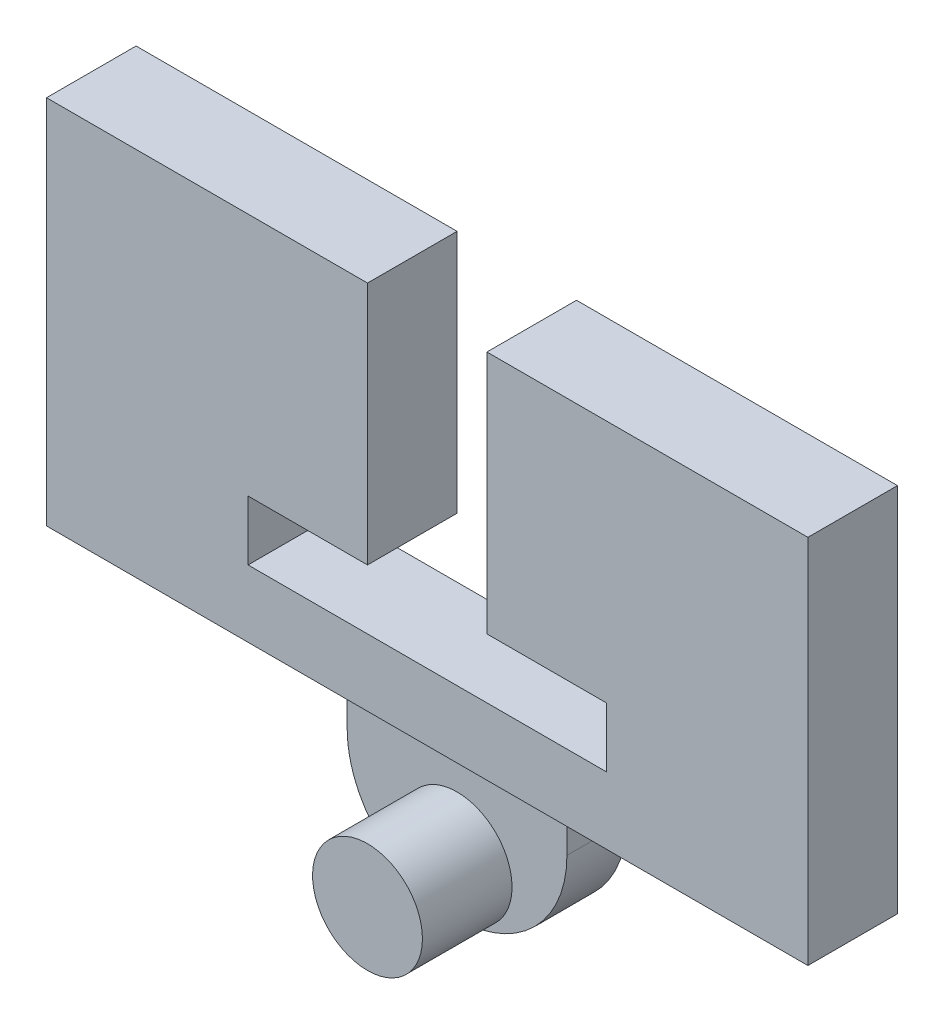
ISO-10303-21;
HEADER;
FILE_DESCRIPTION(('STEP AP214'),'2;1');
FILE_NAME('part.step','',(''),(''),'','','');
FILE_SCHEMA(('AUTOMOTIVE_DESIGN { 1 0 10303 214 1 1 1 1 }'));
ENDSEC;
DATA;
#1=APPLICATION_CONTEXT('core data for automotive mechanical design processes');
#2=APPLICATION_PROTOCOL_DEFINITION('international standard','automotive_design',2000,#1);
#3=PRODUCT_CONTEXT('',#1,'mechanical');
#4=PRODUCT('Part','Part','',(#3));
#5=PRODUCT_RELATED_PRODUCT_CATEGORY('part','',(#4));
#6=PRODUCT_DEFINITION_FORMATION('','',#4);
#7=PRODUCT_DEFINITION_CONTEXT('part definition',#1,'design');
#8=PRODUCT_DEFINITION('design','',#6,#7);
#9=PRODUCT_DEFINITION_SHAPE('','',#8);
#10=(LENGTH_UNIT() NAMED_UNIT(*) SI_UNIT(.MILLI.,.METRE.));
#11=(NAMED_UNIT(*) PLANE_ANGLE_UNIT() SI_UNIT($,.RADIAN.));
#12=(NAMED_UNIT(*) SI_UNIT($,.STERADIAN.) SOLID_ANGLE_UNIT());
#13=UNCERTAINTY_MEASURE_WITH_UNIT(LENGTH_MEASURE(1.E-05),#10,'distance_accuracy_value','');
#14=(GEOMETRIC_REPRESENTATION_CONTEXT(3) GLOBAL_UNCERTAINTY_ASSIGNED_CONTEXT((#13)) GLOBAL_UNIT_ASSIGNED_CONTEXT((#10,
#11,#12)) REPRESENTATION_CONTEXT('',''));
#15=CARTESIAN_POINT('',(0.,0.,0.));
#16=DIRECTION('',(0.,0.,1.));
#17=DIRECTION('',(1.,0.,0.));
#18=AXIS2_PLACEMENT_3D('',#15,#16,#17);
#19=CARTESIAN_POINT('',(-80.9625,49.2966408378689,19.05));
#20=DIRECTION('',(0.,-1.,0.));
#21=DIRECTION('',(0.,0.,-1.));
#22=AXIS2_PLACEMENT_3D('',#19,#20,#21);
#23=PLANE('',#22);
#24=DIRECTION('',(-1.,0.,0.));
#25=VECTOR('',#24,1.);
#26=CARTESIAN_POINT('',(-80.9625,49.2966408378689,19.05));
#27=LINE('',#26,#25);
#28=CARTESIAN_POINT('',(38.1,49.2966408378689,19.05));
#29=VERTEX_POINT('',#28);
#30=CARTESIAN_POINT('',(-38.1,49.2966408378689,19.05));
#31=VERTEX_POINT('',#30);
#32=EDGE_CURVE('E183',#29,#31,#27,.T.);
#33=ORIENTED_EDGE('',*,*,#32,.F.);
#34=DIRECTION('',(0.,0.,-1.));
#35=VECTOR('',#34,1.);
#36=CARTESIAN_POINT('',(38.1,49.2966408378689,19.05));
#37=LINE('',#36,#35);
#38=CARTESIAN_POINT('',(38.1,49.2966408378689,0.));
#39=VERTEX_POINT('',#38);
#40=EDGE_CURVE('E257',#29,#39,#37,.T.);
#41=ORIENTED_EDGE('',*,*,#40,.T.);
#42=DIRECTION('',(-1.,0.,0.));
#43=VECTOR('',#42,1.);
#44=CARTESIAN_POINT('',(-80.9625,49.2966408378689,0.));
#45=LINE('',#44,#43);
#46=CARTESIAN_POINT('',(-38.1,49.2966408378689,0.));
#47=VERTEX_POINT('',#46);
#48=EDGE_CURVE('E282',#39,#47,#45,.T.);
#49=ORIENTED_EDGE('',*,*,#48,.T.);
#50=DIRECTION('',(0.,0.,-1.));
#51=VECTOR('',#50,1.);
#52=CARTESIAN_POINT('',(-38.1,49.2966408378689,19.05));
#53=LINE('',#52,#51);
#54=EDGE_CURVE('E68',#31,#47,#53,.T.);
#55=ORIENTED_EDGE('',*,*,#54,.F.);
#56=EDGE_LOOP('',(#33,#41,#49,#55));
#57=FACE_BOUND('',#56,.T.);
#58=ADVANCED_FACE('F52',(#57),#23,.F.);
#59=CARTESIAN_POINT('',(0.,23.3664038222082,12.7));
#60=DIRECTION('',(0.,0.,-1.));
#61=DIRECTION('',(-1.,0.,0.));
#62=AXIS2_PLACEMENT_3D('',#59,#60,#61);
#63=CYLINDRICAL_SURFACE('',#62,23.3664038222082);
#64=CARTESIAN_POINT('',(0.,23.3664038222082,0.));
#65=DIRECTION('',(0.,0.,1.));
#66=DIRECTION('',(-1.,0.,0.));
#67=AXIS2_PLACEMENT_3D('',#64,#65,#66);
#68=CIRCLE('',#67,23.3664038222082);
#69=CARTESIAN_POINT('',(-23.3664038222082,23.3664038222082,0.));
#70=VERTEX_POINT('',#69);
#71=CARTESIAN_POINT('',(23.3664038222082,23.3664038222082,0.));
#72=VERTEX_POINT('',#71);
#73=EDGE_CURVE('E391',#70,#72,#68,.T.);
#74=ORIENTED_EDGE('',*,*,#73,.T.);
#75=DIRECTION('',(0.,0.,-1.));
#76=VECTOR('',#75,1.);
#77=CARTESIAN_POINT('',(23.3664038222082,23.3664038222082,12.7));
#78=LINE('',#77,#76);
#79=CARTESIAN_POINT('',(23.3664038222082,23.3664038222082,12.7));
#80=VERTEX_POINT('',#79);
#81=EDGE_CURVE('E12',#80,#72,#78,.T.);
#82=ORIENTED_EDGE('',*,*,#81,.F.);
#83=CARTESIAN_POINT('',(0.,23.3664038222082,12.7));
#84=DIRECTION('',(0.,0.,1.));
#85=DIRECTION('',(-1.,0.,0.));
#86=AXIS2_PLACEMENT_3D('',#83,#84,#85);
#87=CIRCLE('',#86,23.3664038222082);
#88=CARTESIAN_POINT('',(0.,0.,12.7));
#89=VERTEX_POINT('',#88);
#90=EDGE_CURVE('E299',#89,#80,#87,.T.);
#91=ORIENTED_EDGE('',*,*,#90,.F.);
#92=CARTESIAN_POINT('',(-23.3664038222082,23.3664038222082,12.7));
#93=VERTEX_POINT('',#92);
#94=EDGE_CURVE('E293',#93,#89,#87,.T.);
#95=ORIENTED_EDGE('',*,*,#94,.F.);
#96=DIRECTION('',(0.,0.,-1.));
#97=VECTOR('',#96,1.);
#98=CARTESIAN_POINT('',(-23.3664038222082,23.3664038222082,12.7));
#99=LINE('',#98,#97);
#100=EDGE_CURVE('E412',#93,#70,#99,.T.);
#101=ORIENTED_EDGE('',*,*,#100,.T.);
#102=EDGE_LOOP('',(#74,#82,#91,#95,#101));
#103=FACE_BOUND('',#102,.T.);
#104=ADVANCED_FACE('F54',(#103),#63,.T.);
#105=CARTESIAN_POINT('',(23.3664038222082,23.3664038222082,12.7));
#106=DIRECTION('',(-1.,0.,0.));
#107=DIRECTION('',(0.,-1.,0.));
#108=AXIS2_PLACEMENT_3D('',#105,#106,#107);
#109=PLANE('',#108);
#110=DIRECTION('',(0.,1.,0.));
#111=VECTOR('',#110,1.);
#112=CARTESIAN_POINT('',(23.3664038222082,23.3664038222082,0.));
#113=LINE('',#112,#111);
#114=CARTESIAN_POINT('',(23.3664038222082,35.0496057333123,0.));
#115=VERTEX_POINT('',#114);
#116=EDGE_CURVE('E397',#72,#115,#113,.T.);
#117=ORIENTED_EDGE('',*,*,#116,.T.);
#118=DIRECTION('',(0.,0.,-1.));
#119=VECTOR('',#118,1.);
#120=CARTESIAN_POINT('',(23.3664038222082,35.0496057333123,12.7));
#121=LINE('',#120,#119);
#122=CARTESIAN_POINT('',(23.3664038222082,35.0496057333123,12.7));
#123=VERTEX_POINT('',#122);
#124=EDGE_CURVE('E61',#123,#115,#121,.T.);
#125=ORIENTED_EDGE('',*,*,#124,.F.);
#126=DIRECTION('',(0.,1.,0.));
#127=VECTOR('',#126,1.);
#128=CARTESIAN_POINT('',(23.3664038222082,23.3664038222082,12.7));
#129=LINE('',#128,#127);
#130=EDGE_CURVE('E298',#80,#123,#129,.T.);
#131=ORIENTED_EDGE('',*,*,#130,.F.);
#132=ORIENTED_EDGE('',*,*,#81,.T.);
#133=EDGE_LOOP('',(#117,#125,#131,#132));
#134=FACE_BOUND('',#133,.T.);
#135=ADVANCED_FACE('F559',(#134),#109,.F.);
#136=CARTESIAN_POINT('',(-23.3664038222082,23.3664038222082,12.7));
#137=DIRECTION('',(1.,0.,0.));
#138=DIRECTION('',(0.,1.,0.));
#139=AXIS2_PLACEMENT_3D('',#136,#137,#138);
#140=PLANE('',#139);
#141=DIRECTION('',(0.,-1.,0.));
#142=VECTOR('',#141,1.);
#143=CARTESIAN_POINT('',(-23.3664038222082,23.3664038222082,0.));
#144=LINE('',#143,#142);
#145=CARTESIAN_POINT('',(-23.3664038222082,35.0496057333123,0.));
#146=VERTEX_POINT('',#145);
#147=EDGE_CURVE('E404',#146,#70,#144,.T.);
#148=ORIENTED_EDGE('',*,*,#147,.T.);
#149=ORIENTED_EDGE('',*,*,#100,.F.);
#150=DIRECTION('',(0.,-1.,0.));
#151=VECTOR('',#150,1.);
#152=CARTESIAN_POINT('',(-23.3664038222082,23.3664038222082,12.7));
#153=LINE('',#152,#151);
#154=CARTESIAN_POINT('',(-23.3664038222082,35.0496057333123,12.7));
#155=VERTEX_POINT('',#154);
#156=EDGE_CURVE('E407',#155,#93,#153,.T.);
#157=ORIENTED_EDGE('',*,*,#156,.F.);
#158=DIRECTION('',(0.,0.,-1.));
#159=VECTOR('',#158,1.);
#160=CARTESIAN_POINT('',(-23.3664038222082,35.0496057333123,12.7));
#161=LINE('',#160,#159);
#162=EDGE_CURVE('E415',#155,#146,#161,.T.);
#163=ORIENTED_EDGE('',*,*,#162,.T.);
#164=EDGE_LOOP('',(#148,#149,#157,#163));
#165=FACE_BOUND('',#164,.T.);
#166=ADVANCED_FACE('F539',(#165),#140,.F.);
#167=CARTESIAN_POINT('',(0.,23.3664038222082,12.7));
#168=DIRECTION('',(0.,0.,-1.));
#169=DIRECTION('',(-1.,0.,0.));
#170=AXIS2_PLACEMENT_3D('',#167,#168,#169);
#171=PLANE('',#170);
#172=ORIENTED_EDGE('',*,*,#94,.T.);
#173=CARTESIAN_POINT('',(0.,11.6832019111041,12.7));
#174=DIRECTION('',(0.,0.,1.));
#175=DIRECTION('',(1.,0.,0.));
#176=AXIS2_PLACEMENT_3D('',#173,#174,#175);
#177=CIRCLE('',#176,11.6832019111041);
#178=EDGE_CURVE('E300',#89,#89,#177,.T.);
#179=ORIENTED_EDGE('',*,*,#178,.F.);
#180=ORIENTED_EDGE('',*,*,#90,.T.);
#181=ORIENTED_EDGE('',*,*,#130,.T.);
#182=DIRECTION('',(-1.,0.,0.));
#183=VECTOR('',#182,1.);
#184=CARTESIAN_POINT('',(-23.3664038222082,35.0496057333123,12.7));
#185=LINE('',#184,#183);
#186=EDGE_CURVE('E425',#123,#155,#185,.T.);
#187=ORIENTED_EDGE('',*,*,#186,.T.);
#188=ORIENTED_EDGE('',*,*,#156,.T.);
#189=EDGE_LOOP('',(#172,#179,#180,#181,#187,#188));
#190=FACE_BOUND('',#189,.T.);
#191=ADVANCED_FACE('F534',(#190),#171,.F.);
#192=CARTESIAN_POINT('',(0.,23.3664038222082,0.));
#193=DIRECTION('',(0.,0.,-1.));
#194=DIRECTION('',(-1.,0.,0.));
#195=AXIS2_PLACEMENT_3D('',#192,#193,#194);
#196=PLANE('',#195);
#197=ORIENTED_EDGE('',*,*,#73,.F.);
#198=ORIENTED_EDGE('',*,*,#147,.F.);
#199=DIRECTION('',(1.,0.,0.));
#200=VECTOR('',#199,1.);
#201=CARTESIAN_POINT('',(-80.9625,35.0496057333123,0.));
#202=LINE('',#201,#200);
#203=CARTESIAN_POINT('',(-80.9625,35.0496057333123,0.));
#204=VERTEX_POINT('',#203);
#205=EDGE_CURVE('E373',#204,#146,#202,.T.);
#206=ORIENTED_EDGE('',*,*,#205,.F.);
#207=DIRECTION('',(0.,-1.,0.));
#208=VECTOR('',#207,1.);
#209=CARTESIAN_POINT('',(-80.9625,35.0496057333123,0.));
#210=LINE('',#209,#208);
#211=CARTESIAN_POINT('',(-80.9625,113.920861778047,0.));
#212=VERTEX_POINT('',#211);
#213=EDGE_CURVE('E256',#212,#204,#210,.T.);
#214=ORIENTED_EDGE('',*,*,#213,.F.);
#215=DIRECTION('',(-1.,0.,0.));
#216=VECTOR('',#215,1.);
#217=CARTESIAN_POINT('',(-80.9625,113.920861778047,0.));
#218=LINE('',#217,#216);
#219=CARTESIAN_POINT('',(-12.7,113.920861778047,0.));
#220=VERTEX_POINT('',#219);
#221=EDGE_CURVE('E340',#220,#212,#218,.T.);
#222=ORIENTED_EDGE('',*,*,#221,.F.);
#223=DIRECTION('',(0.,1.,0.));
#224=VECTOR('',#223,1.);
#225=CARTESIAN_POINT('',(-12.7,61.9966408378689,0.));
#226=LINE('',#225,#224);
#227=CARTESIAN_POINT('',(-12.7,61.9966408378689,0.));
#228=VERTEX_POINT('',#227);
#229=EDGE_CURVE('E335',#228,#220,#226,.T.);
#230=ORIENTED_EDGE('',*,*,#229,.F.);
#231=DIRECTION('',(1.,0.,0.));
#232=VECTOR('',#231,1.);
#233=CARTESIAN_POINT('',(-80.9625,61.9966408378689,0.));
#234=LINE('',#233,#232);
#235=CARTESIAN_POINT('',(-38.1,61.9966408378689,0.));
#236=VERTEX_POINT('',#235);
#237=EDGE_CURVE('E239',#236,#228,#234,.T.);
#238=ORIENTED_EDGE('',*,*,#237,.F.);
#239=DIRECTION('',(0.,1.,0.));
#240=VECTOR('',#239,1.);
#241=CARTESIAN_POINT('',(-38.1,49.2966408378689,0.));
#242=LINE('',#241,#240);
#243=EDGE_CURVE('E277',#47,#236,#242,.T.);
#244=ORIENTED_EDGE('',*,*,#243,.F.);
#245=ORIENTED_EDGE('',*,*,#48,.F.);
#246=DIRECTION('',(0.,-1.,0.));
#247=VECTOR('',#246,1.);
#248=CARTESIAN_POINT('',(38.1,49.2966408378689,0.));
#249=LINE('',#248,#247);
#250=CARTESIAN_POINT('',(38.1,61.9966408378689,0.));
#251=VERTEX_POINT('',#250);
#252=EDGE_CURVE('E76',#251,#39,#249,.T.);
#253=ORIENTED_EDGE('',*,*,#252,.F.);
#254=DIRECTION('',(1.,0.,0.));
#255=VECTOR('',#254,1.);
#256=CARTESIAN_POINT('',(80.9625,61.9966408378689,0.));
#257=LINE('',#256,#255);
#258=CARTESIAN_POINT('',(12.7,61.9966408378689,0.));
#259=VERTEX_POINT('',#258);
#260=EDGE_CURVE('E194',#259,#251,#257,.T.);
#261=ORIENTED_EDGE('',*,*,#260,.F.);
#262=DIRECTION('',(0.,-1.,0.));
#263=VECTOR('',#262,1.);
#264=CARTESIAN_POINT('',(12.7,61.9966408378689,0.));
#265=LINE('',#264,#263);
#266=CARTESIAN_POINT('',(12.7,113.920861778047,0.));
#267=VERTEX_POINT('',#266);
#268=EDGE_CURVE('E233',#267,#259,#265,.T.);
#269=ORIENTED_EDGE('',*,*,#268,.F.);
#270=DIRECTION('',(-1.,0.,0.));
#271=VECTOR('',#270,1.);
#272=CARTESIAN_POINT('',(80.9625,113.920861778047,0.));
#273=LINE('',#272,#271);
#274=CARTESIAN_POINT('',(80.9625,113.920861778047,0.));
#275=VERTEX_POINT('',#274);
#276=EDGE_CURVE('E236',#275,#267,#273,.T.);
#277=ORIENTED_EDGE('',*,*,#276,.F.);
#278=DIRECTION('',(0.,1.,0.));
#279=VECTOR('',#278,1.);
#280=CARTESIAN_POINT('',(80.9625,35.0496057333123,0.));
#281=LINE('',#280,#279);
#282=CARTESIAN_POINT('',(80.9625,35.0496057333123,0.));
#283=VERTEX_POINT('',#282);
#284=EDGE_CURVE('E198',#283,#275,#281,.T.);
#285=ORIENTED_EDGE('',*,*,#284,.F.);
#286=EDGE_CURVE('E263',#115,#283,#202,.T.);
#287=ORIENTED_EDGE('',*,*,#286,.F.);
#288=ORIENTED_EDGE('',*,*,#116,.F.);
#289=EDGE_LOOP('',(#197,#198,#206,#214,#222,#230,#238,#244,#245,#253,#261,#269,#277,#285,#287,#288));
#290=FACE_BOUND('',#289,.T.);
#291=ADVANCED_FACE('F333',(#290),#196,.T.);
#292=CARTESIAN_POINT('',(0.,11.6832019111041,31.75));
#293=DIRECTION('',(0.,0.,-1.));
#294=DIRECTION('',(-1.,0.,0.));
#295=AXIS2_PLACEMENT_3D('',#292,#293,#294);
#296=CYLINDRICAL_SURFACE('',#295,11.6832019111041);
#297=CARTESIAN_POINT('',(0.,11.6832019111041,31.75));
#298=DIRECTION('',(0.,0.,1.));
#299=DIRECTION('',(1.,0.,0.));
#300=AXIS2_PLACEMENT_3D('',#297,#298,#299);
#301=CIRCLE('',#300,11.6832019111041);
#302=CARTESIAN_POINT('',(11.6832019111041,11.6832019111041,31.75));
#303=VERTEX_POINT('',#302);
#304=EDGE_CURVE('E386',#303,#303,#301,.T.);
#305=ORIENTED_EDGE('',*,*,#304,.F.);
#306=EDGE_LOOP('',(#305));
#307=FACE_BOUND('',#306,.T.);
#308=ORIENTED_EDGE('',*,*,#178,.T.);
#309=EDGE_LOOP('',(#308));
#310=FACE_BOUND('',#309,.T.);
#311=ADVANCED_FACE('F541',(#307,#310),#296,.T.);
#312=CARTESIAN_POINT('',(0.,11.6832019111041,31.75));
#313=DIRECTION('',(0.,0.,1.));
#314=DIRECTION('',(1.,0.,0.));
#315=AXIS2_PLACEMENT_3D('',#312,#313,#314);
#316=PLANE('',#315);
#317=ORIENTED_EDGE('',*,*,#304,.T.);
#318=EDGE_LOOP('',(#317));
#319=FACE_BOUND('',#318,.T.);
#320=ADVANCED_FACE('F543',(#319),#316,.T.);
#321=CARTESIAN_POINT('',(-80.9625,35.0496057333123,19.05));
#322=DIRECTION('',(1.,0.,0.));
#323=DIRECTION('',(0.,0.,-1.));
#324=AXIS2_PLACEMENT_3D('',#321,#322,#323);
#325=PLANE('',#324);
#326=ORIENTED_EDGE('',*,*,#213,.T.);
#327=DIRECTION('',(0.,0.,-1.));
#328=VECTOR('',#327,1.);
#329=CARTESIAN_POINT('',(-80.9625,35.0496057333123,19.05));
#330=LINE('',#329,#328);
#331=CARTESIAN_POINT('',(-80.9625,35.0496057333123,19.05));
#332=VERTEX_POINT('',#331);
#333=EDGE_CURVE('E377',#332,#204,#330,.T.);
#334=ORIENTED_EDGE('',*,*,#333,.F.);
#335=DIRECTION('',(0.,-1.,0.));
#336=VECTOR('',#335,1.);
#337=CARTESIAN_POINT('',(-80.9625,35.0496057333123,19.05));
#338=LINE('',#337,#336);
#339=CARTESIAN_POINT('',(-80.9625,113.920861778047,19.05));
#340=VERTEX_POINT('',#339);
#341=EDGE_CURVE('E278',#340,#332,#338,.T.);
#342=ORIENTED_EDGE('',*,*,#341,.F.);
#343=DIRECTION('',(0.,0.,-1.));
#344=VECTOR('',#343,1.);
#345=CARTESIAN_POINT('',(-80.9625,113.920861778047,19.05));
#346=LINE('',#345,#344);
#347=EDGE_CURVE('E348',#340,#212,#346,.T.);
#348=ORIENTED_EDGE('',*,*,#347,.T.);
#349=EDGE_LOOP('',(#326,#334,#342,#348));
#350=FACE_BOUND('',#349,.T.);
#351=ADVANCED_FACE('F376',(#350),#325,.F.);
#352=CARTESIAN_POINT('',(-80.9625,35.0496057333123,19.05));
#353=DIRECTION('',(0.,1.,0.));
#354=DIRECTION('',(0.,0.,1.));
#355=AXIS2_PLACEMENT_3D('',#352,#353,#354);
#356=PLANE('',#355);
#357=ORIENTED_EDGE('',*,*,#162,.F.);
#358=ORIENTED_EDGE('',*,*,#186,.F.);
#359=ORIENTED_EDGE('',*,*,#124,.T.);
#360=ORIENTED_EDGE('',*,*,#286,.T.);
#361=DIRECTION('',(0.,0.,-1.));
#362=VECTOR('',#361,1.);
#363=CARTESIAN_POINT('',(80.9625,35.0496057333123,19.05));
#364=LINE('',#363,#362);
#365=CARTESIAN_POINT('',(80.9625,35.0496057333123,19.05));
#366=VERTEX_POINT('',#365);
#367=EDGE_CURVE('E380',#366,#283,#364,.T.);
#368=ORIENTED_EDGE('',*,*,#367,.F.);
#369=DIRECTION('',(1.,0.,0.));
#370=VECTOR('',#369,1.);
#371=CARTESIAN_POINT('',(-80.9625,35.0496057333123,19.05));
#372=LINE('',#371,#370);
#373=EDGE_CURVE('E177',#332,#366,#372,.T.);
#374=ORIENTED_EDGE('',*,*,#373,.F.);
#375=ORIENTED_EDGE('',*,*,#333,.T.);
#376=ORIENTED_EDGE('',*,*,#205,.T.);
#377=EDGE_LOOP('',(#357,#358,#359,#360,#368,#374,#375,#376));
#378=FACE_BOUND('',#377,.T.);
#379=ADVANCED_FACE('F424',(#378),#356,.F.);
#380=CARTESIAN_POINT('',(80.9625,35.0496057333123,19.05));
#381=DIRECTION('',(-1.,0.,0.));
#382=DIRECTION('',(0.,0.,1.));
#383=AXIS2_PLACEMENT_3D('',#380,#381,#382);
#384=PLANE('',#383);
#385=ORIENTED_EDGE('',*,*,#284,.T.);
#386=DIRECTION('',(0.,0.,-1.));
#387=VECTOR('',#386,1.);
#388=CARTESIAN_POINT('',(80.9625,113.920861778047,19.05));
#389=LINE('',#388,#387);
#390=CARTESIAN_POINT('',(80.9625,113.920861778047,19.05));
#391=VERTEX_POINT('',#390);
#392=EDGE_CURVE('E188',#391,#275,#389,.T.);
#393=ORIENTED_EDGE('',*,*,#392,.F.);
#394=DIRECTION('',(0.,1.,0.));
#395=VECTOR('',#394,1.);
#396=CARTESIAN_POINT('',(80.9625,35.0496057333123,19.05));
#397=LINE('',#396,#395);
#398=EDGE_CURVE('E171',#366,#391,#397,.T.);
#399=ORIENTED_EDGE('',*,*,#398,.F.);
#400=ORIENTED_EDGE('',*,*,#367,.T.);
#401=EDGE_LOOP('',(#385,#393,#399,#400));
#402=FACE_BOUND('',#401,.T.);
#403=ADVANCED_FACE('F196',(#402),#384,.F.);
#404=CARTESIAN_POINT('',(0.,0.,19.05));
#405=DIRECTION('',(0.,0.,-1.));
#406=DIRECTION('',(-1.,0.,0.));
#407=AXIS2_PLACEMENT_3D('',#404,#405,#406);
#408=PLANE('',#407);
#409=ORIENTED_EDGE('',*,*,#341,.T.);
#410=ORIENTED_EDGE('',*,*,#373,.T.);
#411=ORIENTED_EDGE('',*,*,#398,.T.);
#412=DIRECTION('',(-1.,0.,0.));
#413=VECTOR('',#412,1.);
#414=CARTESIAN_POINT('',(80.9625,113.920861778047,19.05));
#415=LINE('',#414,#413);
#416=CARTESIAN_POINT('',(12.7,113.920861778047,19.05));
#417=VERTEX_POINT('',#416);
#418=EDGE_CURVE('E175',#391,#417,#415,.T.);
#419=ORIENTED_EDGE('',*,*,#418,.T.);
#420=DIRECTION('',(0.,-1.,0.));
#421=VECTOR('',#420,1.);
#422=CARTESIAN_POINT('',(12.7,61.9966408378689,19.05));
#423=LINE('',#422,#421);
#424=CARTESIAN_POINT('',(12.7,61.9966408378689,19.05));
#425=VERTEX_POINT('',#424);
#426=EDGE_CURVE('E193',#417,#425,#423,.T.);
#427=ORIENTED_EDGE('',*,*,#426,.T.);
#428=DIRECTION('',(1.,0.,0.));
#429=VECTOR('',#428,1.);
#430=CARTESIAN_POINT('',(80.9625,61.9966408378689,19.05));
#431=LINE('',#430,#429);
#432=CARTESIAN_POINT('',(38.1,61.9966408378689,19.05));
#433=VERTEX_POINT('',#432);
#434=EDGE_CURVE('E229',#425,#433,#431,.T.);
#435=ORIENTED_EDGE('',*,*,#434,.T.);
#436=DIRECTION('',(0.,-1.,0.));
#437=VECTOR('',#436,1.);
#438=CARTESIAN_POINT('',(38.1,49.2966408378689,19.05));
#439=LINE('',#438,#437);
#440=EDGE_CURVE('E265',#433,#29,#439,.T.);
#441=ORIENTED_EDGE('',*,*,#440,.T.);
#442=ORIENTED_EDGE('',*,*,#32,.T.);
#443=DIRECTION('',(0.,1.,0.));
#444=VECTOR('',#443,1.);
#445=CARTESIAN_POINT('',(-38.1,49.2966408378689,19.05));
#446=LINE('',#445,#444);
#447=CARTESIAN_POINT('',(-38.1,61.9966408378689,19.05));
#448=VERTEX_POINT('',#447);
#449=EDGE_CURVE('E273',#31,#448,#446,.T.);
#450=ORIENTED_EDGE('',*,*,#449,.T.);
#451=DIRECTION('',(1.,0.,0.));
#452=VECTOR('',#451,1.);
#453=CARTESIAN_POINT('',(-80.9625,61.9966408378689,19.05));
#454=LINE('',#453,#452);
#455=CARTESIAN_POINT('',(-12.7,61.9966408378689,19.05));
#456=VERTEX_POINT('',#455);
#457=EDGE_CURVE('E311',#448,#456,#454,.T.);
#458=ORIENTED_EDGE('',*,*,#457,.T.);
#459=DIRECTION('',(0.,1.,0.));
#460=VECTOR('',#459,1.);
#461=CARTESIAN_POINT('',(-12.7,61.9966408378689,19.05));
#462=LINE('',#461,#460);
#463=CARTESIAN_POINT('',(-12.7,113.920861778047,19.05));
#464=VERTEX_POINT('',#463);
#465=EDGE_CURVE('E347',#456,#464,#462,.T.);
#466=ORIENTED_EDGE('',*,*,#465,.T.);
#467=DIRECTION('',(-1.,0.,0.));
#468=VECTOR('',#467,1.);
#469=CARTESIAN_POINT('',(-80.9625,113.920861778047,19.05));
#470=LINE('',#469,#468);
#471=EDGE_CURVE('E344',#464,#340,#470,.T.);
#472=ORIENTED_EDGE('',*,*,#471,.T.);
#473=EDGE_LOOP('',(#409,#410,#411,#419,#427,#435,#441,#442,#450,#458,#466,#472));
#474=FACE_BOUND('',#473,.T.);
#475=ADVANCED_FACE('F174',(#474),#408,.F.);
#476=CARTESIAN_POINT('',(-38.1,49.2966408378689,19.05));
#477=DIRECTION('',(-1.,0.,0.));
#478=DIRECTION('',(0.,0.,1.));
#479=AXIS2_PLACEMENT_3D('',#476,#477,#478);
#480=PLANE('',#479);
#481=ORIENTED_EDGE('',*,*,#243,.T.);
#482=DIRECTION('',(0.,0.,-1.));
#483=VECTOR('',#482,1.);
#484=CARTESIAN_POINT('',(-38.1,61.9966408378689,19.05));
#485=LINE('',#484,#483);
#486=EDGE_CURVE('E205',#448,#236,#485,.T.);
#487=ORIENTED_EDGE('',*,*,#486,.F.);
#488=ORIENTED_EDGE('',*,*,#449,.F.);
#489=ORIENTED_EDGE('',*,*,#54,.T.);
#490=EDGE_LOOP('',(#481,#487,#488,#489));
#491=FACE_BOUND('',#490,.T.);
#492=ADVANCED_FACE('F321',(#491),#480,.F.);
#493=CARTESIAN_POINT('',(38.1,49.2966408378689,19.05));
#494=DIRECTION('',(1.,0.,0.));
#495=DIRECTION('',(0.,0.,-1.));
#496=AXIS2_PLACEMENT_3D('',#493,#494,#495);
#497=PLANE('',#496);
#498=ORIENTED_EDGE('',*,*,#252,.T.);
#499=ORIENTED_EDGE('',*,*,#40,.F.);
#500=ORIENTED_EDGE('',*,*,#440,.F.);
#501=DIRECTION('',(0.,0.,-1.));
#502=VECTOR('',#501,1.);
#503=CARTESIAN_POINT('',(38.1,61.9966408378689,19.05));
#504=LINE('',#503,#502);
#505=EDGE_CURVE('E254',#433,#251,#504,.T.);
#506=ORIENTED_EDGE('',*,*,#505,.T.);
#507=EDGE_LOOP('',(#498,#499,#500,#506));
#508=FACE_BOUND('',#507,.T.);
#509=ADVANCED_FACE('F438',(#508),#497,.F.);
#510=CARTESIAN_POINT('',(80.9625,61.9966408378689,19.05));
#511=DIRECTION('',(0.,1.,0.));
#512=DIRECTION('',(-1.,0.,0.));
#513=AXIS2_PLACEMENT_3D('',#510,#511,#512);
#514=PLANE('',#513);
#515=ORIENTED_EDGE('',*,*,#260,.T.);
#516=ORIENTED_EDGE('',*,*,#505,.F.);
#517=ORIENTED_EDGE('',*,*,#434,.F.);
#518=DIRECTION('',(0.,0.,-1.));
#519=VECTOR('',#518,1.);
#520=CARTESIAN_POINT('',(12.7,61.9966408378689,19.05));
#521=LINE('',#520,#519);
#522=EDGE_CURVE('E207',#425,#259,#521,.T.);
#523=ORIENTED_EDGE('',*,*,#522,.T.);
#524=EDGE_LOOP('',(#515,#516,#517,#523));
#525=FACE_BOUND('',#524,.T.);
#526=ADVANCED_FACE('F253',(#525),#514,.F.);
#527=CARTESIAN_POINT('',(80.9625,113.920861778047,19.05));
#528=DIRECTION('',(0.,-1.,0.));
#529=DIRECTION('',(0.,0.,-1.));
#530=AXIS2_PLACEMENT_3D('',#527,#528,#529);
#531=PLANE('',#530);
#532=ORIENTED_EDGE('',*,*,#276,.T.);
#533=DIRECTION('',(0.,0.,-1.));
#534=VECTOR('',#533,1.);
#535=CARTESIAN_POINT('',(12.7,113.920861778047,19.05));
#536=LINE('',#535,#534);
#537=EDGE_CURVE('E190',#417,#267,#536,.T.);
#538=ORIENTED_EDGE('',*,*,#537,.F.);
#539=ORIENTED_EDGE('',*,*,#418,.F.);
#540=ORIENTED_EDGE('',*,*,#392,.T.);
#541=EDGE_LOOP('',(#532,#538,#539,#540));
#542=FACE_BOUND('',#541,.T.);
#543=ADVANCED_FACE('F187',(#542),#531,.F.);
#544=CARTESIAN_POINT('',(12.7,61.9966408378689,19.05));
#545=DIRECTION('',(1.,0.,0.));
#546=DIRECTION('',(0.,1.,0.));
#547=AXIS2_PLACEMENT_3D('',#544,#545,#546);
#548=PLANE('',#547);
#549=ORIENTED_EDGE('',*,*,#268,.T.);
#550=ORIENTED_EDGE('',*,*,#522,.F.);
#551=ORIENTED_EDGE('',*,*,#426,.F.);
#552=ORIENTED_EDGE('',*,*,#537,.T.);
#553=EDGE_LOOP('',(#549,#550,#551,#552));
#554=FACE_BOUND('',#553,.T.);
#555=ADVANCED_FACE('F249',(#554),#548,.F.);
#556=CARTESIAN_POINT('',(-80.9625,61.9966408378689,19.05));
#557=DIRECTION('',(0.,1.,0.));
#558=DIRECTION('',(-1.,0.,0.));
#559=AXIS2_PLACEMENT_3D('',#556,#557,#558);
#560=PLANE('',#559);
#561=ORIENTED_EDGE('',*,*,#457,.F.);
#562=ORIENTED_EDGE('',*,*,#486,.T.);
#563=ORIENTED_EDGE('',*,*,#237,.T.);
#564=DIRECTION('',(0.,0.,-1.));
#565=VECTOR('',#564,1.);
#566=CARTESIAN_POINT('',(-12.7,61.9966408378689,19.05));
#567=LINE('',#566,#565);
#568=EDGE_CURVE('E211',#456,#228,#567,.T.);
#569=ORIENTED_EDGE('',*,*,#568,.F.);
#570=EDGE_LOOP('',(#561,#562,#563,#569));
#571=FACE_BOUND('',#570,.T.);
#572=ADVANCED_FACE('F328',(#571),#560,.F.);
#573=CARTESIAN_POINT('',(-12.7,61.9966408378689,19.05));
#574=DIRECTION('',(-1.,0.,0.));
#575=DIRECTION('',(0.,-1.,0.));
#576=AXIS2_PLACEMENT_3D('',#573,#574,#575);
#577=PLANE('',#576);
#578=ORIENTED_EDGE('',*,*,#229,.T.);
#579=DIRECTION('',(0.,0.,-1.));
#580=VECTOR('',#579,1.);
#581=CARTESIAN_POINT('',(-12.7,113.920861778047,19.05));
#582=LINE('',#581,#580);
#583=EDGE_CURVE('E216',#464,#220,#582,.T.);
#584=ORIENTED_EDGE('',*,*,#583,.F.);
#585=ORIENTED_EDGE('',*,*,#465,.F.);
#586=ORIENTED_EDGE('',*,*,#568,.T.);
#587=EDGE_LOOP('',(#578,#584,#585,#586));
#588=FACE_BOUND('',#587,.T.);
#589=ADVANCED_FACE('F625',(#588),#577,.F.);
#590=CARTESIAN_POINT('',(-80.9625,113.920861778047,19.05));
#591=DIRECTION('',(0.,-1.,0.));
#592=DIRECTION('',(0.,0.,-1.));
#593=AXIS2_PLACEMENT_3D('',#590,#591,#592);
#594=PLANE('',#593);
#595=ORIENTED_EDGE('',*,*,#221,.T.);
#596=ORIENTED_EDGE('',*,*,#347,.F.);
#597=ORIENTED_EDGE('',*,*,#471,.F.);
#598=ORIENTED_EDGE('',*,*,#583,.T.);
#599=EDGE_LOOP('',(#595,#596,#597,#598));
#600=FACE_BOUND('',#599,.T.);
#601=ADVANCED_FACE('F369',(#600),#594,.F.);
#602=CLOSED_SHELL('',(#58,#104,#135,#166,#191,#291,#311,#320,#351,#379,#403,#475,#492,#509,#526,
#543,#555,#572,#589,#601));
#603=MANIFOLD_SOLID_BREP('B2',#602);
#604=ADVANCED_BREP_SHAPE_REPRESENTATION('',(#18,#603),#14);
#605=SHAPE_DEFINITION_REPRESENTATION(#9,#604);
ENDSEC;
END-ISO-10303-21;
